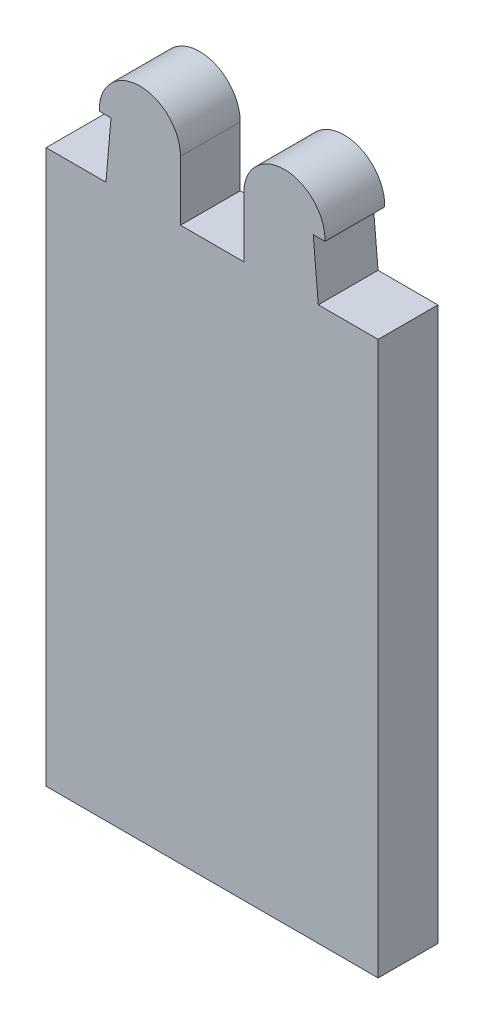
from build123d import *

# Parameters (mm, degrees)
BOSS_EXTRUDE1_DEPTH = 2.7


with BuildPart() as part:
    # Sketch1 → Boss-Extrude1 (new body)
    with BuildSketch(Plane.XY):
        with BuildLine():
            Line((7.50526, -12.5), (-7.50526, -12.5))
            Line((-7.50526, -12.5), (-7.50526, 12.5))
            Line((-7.50526, 12.5), (-4.800095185, 12.5))
            Line((-4.800095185, 12.5), (-4.57, 15.13))
            Line((-4.57, 15.13), (-5.098404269, 15.13))
            ThreePointArc((-5.098404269, 15.13), (-3.299876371, 17.034536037), (-1.43, 15.2))
            Line((-1.43, 15.2), (-1.43, 12.5))
            Line((-1.43, 12.5), (1.43, 12.5))
            Line((1.43, 12.5), (1.43, 15.2))
            ThreePointArc((1.43, 15.2), (3.299876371, 17.034536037), (5.098404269, 15.13))
            Line((5.098404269, 15.13), (4.57, 15.13))
            Line((4.57, 15.13), (4.800095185, 12.5))
            Line((4.800095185, 12.5), (7.50526, 12.5))
            Line((7.50526, 12.5), (7.50526, -12.5))
        make_face()
    extrude(amount=BOSS_EXTRUDE1_DEPTH)


solid = part.part
